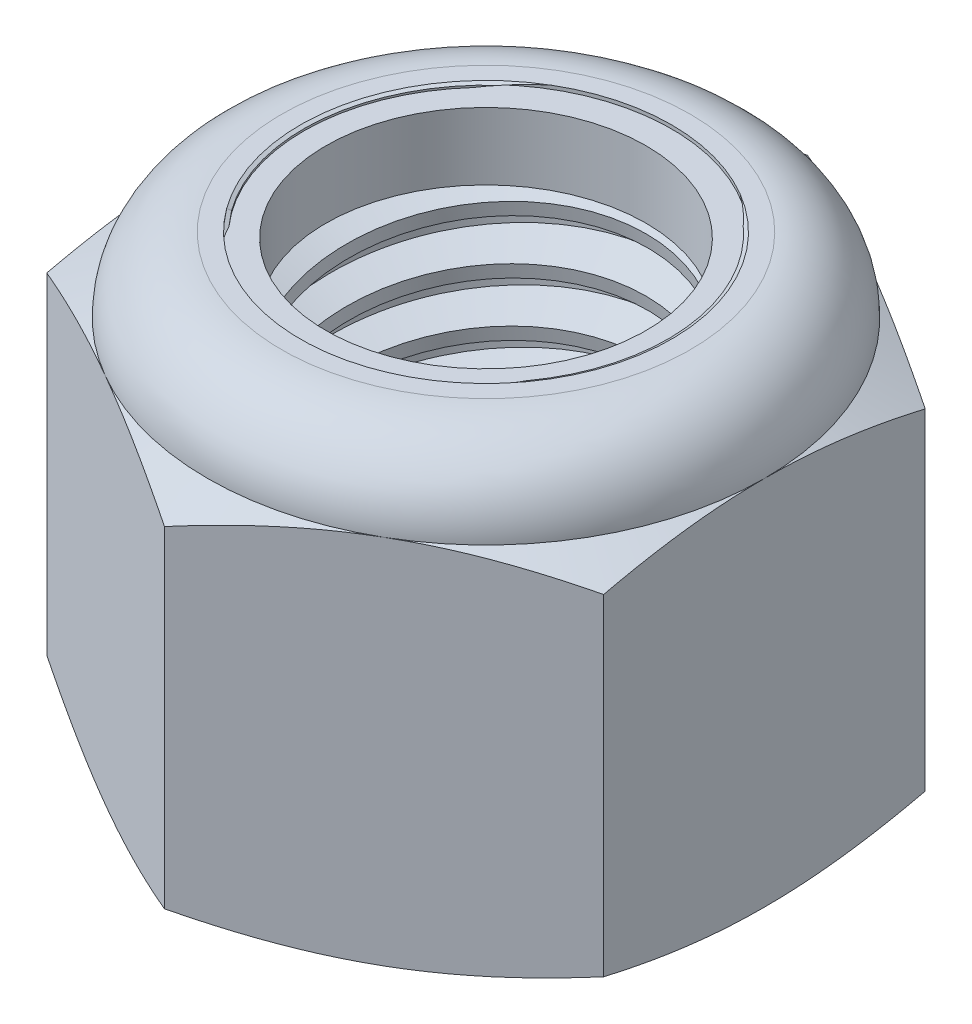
from build123d import *

# Parameters (mm, degrees)
EXTRUDE1_DEPTH      = 19.05
SKETCH2_W           = 7.9375
SKETCH2_H           = 19.05
LPATTERN1_COUNT     = 8
LPATTERN1_PITCH     = 2.309090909
LPATTERN1_COL_COUNT = 2
LPATTERN1_COL_PITCH = 2.309090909


with BuildPart() as part:
    # Sketch1 → Extrude1 (new body)
    with BuildSketch(Plane(origin=(0, 0, 0), x_dir=(1, 0, 0), z_dir=(0, 1, 0))):
        Polygon((0, 13.748153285), (-11.90625, 6.874076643), (-11.90625, -6.874076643), (0, -13.748153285), (11.90625, -6.874076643), (11.90625, 6.874076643), align=None)
    extrude(amount=EXTRUDE1_DEPTH)

    # Sketch4 → Cut-Revolve2 (revolve, cut)
    with BuildSketch(Plane(origin=(0, 0, 0), x_dir=(0, 0, -1), z_dir=(1, 0, 0)), mode=Mode.PRIVATE) as cut_revolve2_sk:
        Polygon((0, 19.05), (7.9375, 19.05), (6.846095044, 18.541069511), (6.846095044, 0.508930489), (7.9375, 0), (0, 0), align=None)
    revolve(cut_revolve2_sk.sketch.rotate(Axis((0, 19.05, 0), (0, 1, 0)), 54.961122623), axis=Axis((0, 19.05, 0), (0, 1, 0)), mode=Mode.SUBTRACT)


with BuildPart() as body_2:
    # Sketch2 → Revolve1 (revolve)
    with BuildSketch(Plane(origin=(0, 0, 0), x_dir=(0, 0, -1), z_dir=(1, 0, 0))):
        with Locations((3.96875, 9.525)):
            Rectangle(SKETCH2_W, SKETCH2_H)
    revolve(axis=Axis((0, -7.9375, 0), (0, 1, 0)))

    # Sketch3 → Cut-Revolve1 (revolve, cut)
    with BuildSketch(Plane(origin=(0, 0, 0), x_dir=(0, 0, -1), z_dir=(1, 0, 0)), mode=Mode.PRIVATE) as cut_revolve1_sk:
        Polygon((7.979046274, 18.764369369), (8.269870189, 16.764954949), (6.929187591, 17.299130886), (6.846095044, 17.870392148), align=None)
    cut_revolve1 = revolve(cut_revolve1_sk.sketch.rotate(Axis((0, 19.05, 0.358847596), (0, -0.9895864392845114, -0.14393984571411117)), 180), axis=Axis((0, 19.05, 0.358847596), (0, -0.9895864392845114, -0.14393984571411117)), mode=Mode.SUBTRACT)

    # LPattern1: Cut-Revolve1 ×8
    with Locations(*[(0, -i * LPATTERN1_PITCH, 0) for i in range(1, LPATTERN1_COUNT)]):
        add(cut_revolve1, mode=Mode.SUBTRACT)

    # LPattern1 col: Cut-Revolve1 ×2
    with Locations(*[(0, i * LPATTERN1_COL_PITCH, 0) for i in range(1, LPATTERN1_COL_COUNT)]):
        add(cut_revolve1, mode=Mode.SUBTRACT)


with BuildPart() as part_1:
    add(part.part)

    # Combine1: cut body 2
    add(body_2.part, mode=Mode.SUBTRACT)

    # Sketch5 → Cut-Revolve3 (revolve, cut)
    with BuildSketch(Plane(origin=(0, 0, 0), x_dir=(0, 0, -1), z_dir=(1, 0, 0)), mode=Mode.PRIVATE) as cut_revolve3_sk:
        with BuildLine():
            Line((0, 0), (11.90625, 0))
            Line((11.90625, 0), (13.748153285, 0.858893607))
            Line((13.748153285, 0.858893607), (13.748153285, 15.016106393))
            Line((13.748153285, 15.016106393), (11.90625, 15.875))
            ThreePointArc((11.90625, 15.875), (10.97631403, 18.12006403), (8.73125, 19.05))
            Line((8.73125, 19.05), (8.73125, 20.32))
            Line((8.73125, 20.32), (15.018153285, 20.32))
            Line((15.018153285, 20.32), (15.018153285, -1.27))
            Line((15.018153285, -1.27), (0, -1.27))
            Line((0, -1.27), (0, 0))
        make_face()
    revolve(cut_revolve3_sk.sketch.rotate(Axis((0, 0, 0), (0, 1, 0)), 54.961122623), axis=Axis((0, 0, 0), (0, 1, 0)), mode=Mode.SUBTRACT)

    # Sketch6 → Cut-Revolve4 (revolve, cut)
    with BuildSketch(Plane(origin=(0, 0, 0), x_dir=(0, 0, -1), z_dir=(1, 0, 0)), mode=Mode.PRIVATE) as cut_revolve4_sk:
        with BuildLine():
            Line((0, 15.875), (11.75385, 15.875))
            ThreePointArc((11.75385, 15.875), (10.868550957, 18.012300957), (8.73125, 18.8976))
            Line((8.73125, 18.8976), (7.788672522, 18.8976))
            Line((7.788672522, 18.8976), (7.788672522, 20.32))
            Line((7.788672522, 20.32), (0, 20.32))
            Line((0, 20.32), (0, 15.875))
        make_face()
    revolve(cut_revolve4_sk.sketch.rotate(Axis((0, 20.32, 0), (0, 1, 0)), 54.961122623), axis=Axis((0, 20.32, 0), (0, 1, 0)), mode=Mode.SUBTRACT)


with BuildPart() as body_2_2:
    # Sketch7 → Revolve2 (revolve)
    with BuildSketch(Plane(origin=(0, 0, 0), x_dir=(0, 0, -1), z_dir=(1, 0, 0)), mode=Mode.PRIVATE) as revolve2_sk:
        with BuildLine():
            Line((6.846095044, 15.9512), (11.67666449, 15.9512))
            ThreePointArc((11.67666449, 15.9512), (10.787552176, 17.985188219), (8.73125, 18.8214))
            Line((8.73125, 18.8214), (6.846095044, 18.8214))
            Line((6.846095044, 18.8214), (6.846095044, 15.9512))
        make_face()
    revolve(revolve2_sk.sketch.rotate(Axis((0, 15.9512, 0), (0, 1, 0)), 54.961122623), axis=Axis((0, 15.9512, 0), (0, 1, 0)))


solid = Compound([part_1.part, body_2_2.part])
